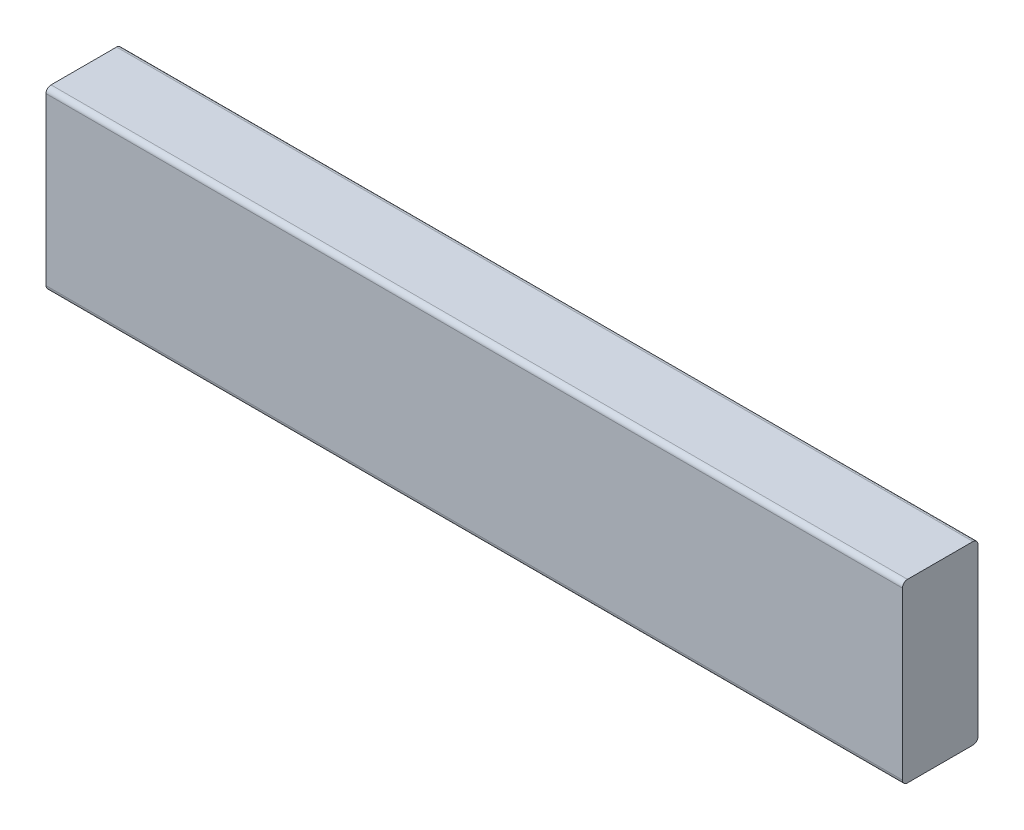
from build123d import *

# Parameters (mm, degrees)
SKETCH1_W      = 38.1
SKETCH1_H      = 88.9
EXTRUDE1_DEPTH = 215.9
FILLET1_R      = 2.54


with BuildPart() as part:
    # Sketch1 → Extrude1 (new, symmetric)
    with BuildSketch(Plane(origin=(0, 0, 0), x_dir=(0, 0, -1), z_dir=(1, 0, 0))):
        Rectangle(SKETCH1_W, SKETCH1_H)
    extrude(amount=EXTRUDE1_DEPTH, both=True)

    # Fillet1
    fillet1_edges = [part.edges().sort_by_distance(p)[0] for p in [
        (0, -44.45, -19.05),
        (0, -44.45, 19.05),
        (0, 44.45, 19.05),
        (0, 44.45, -19.05),
    ]]
    fillet(fillet1_edges, radius=FILLET1_R)


solid = part.part
